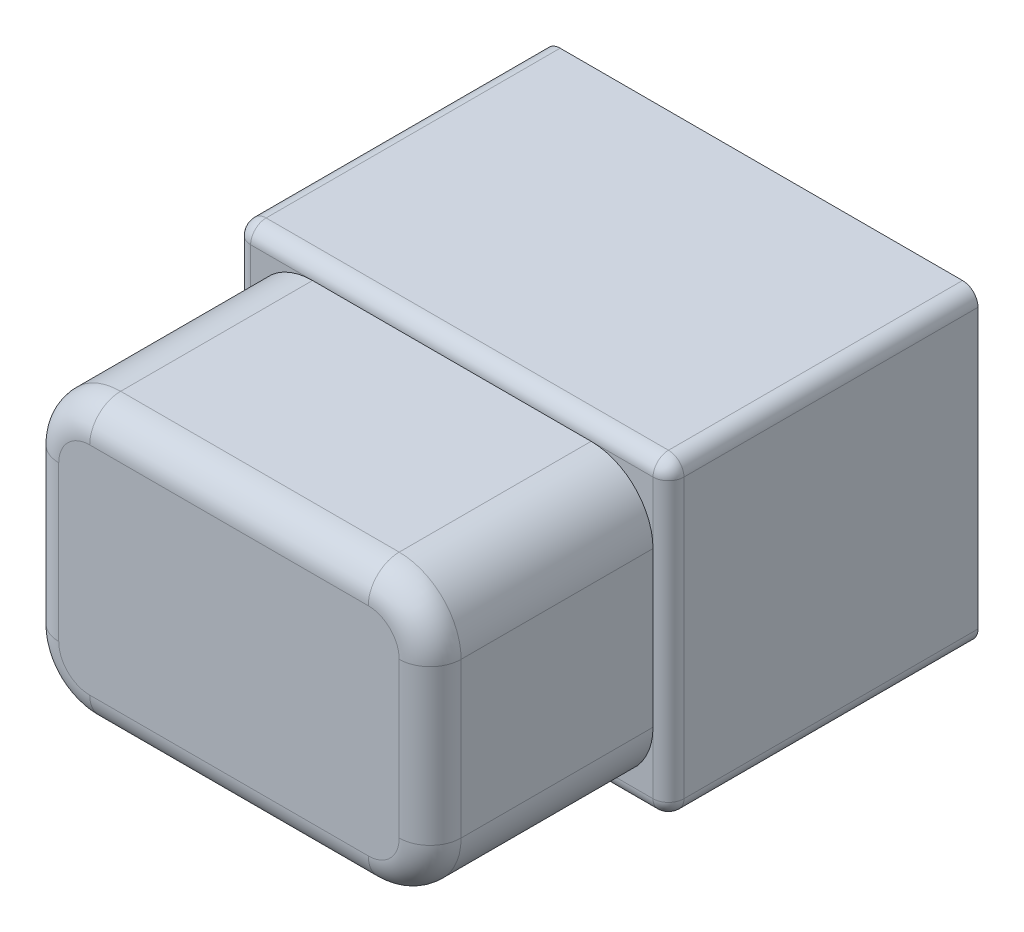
ISO-10303-21;
HEADER;
FILE_DESCRIPTION(('STEP AP214'),'2;1');
FILE_NAME('part.step','',(''),(''),'','','');
FILE_SCHEMA(('AUTOMOTIVE_DESIGN { 1 0 10303 214 1 1 1 1 }'));
ENDSEC;
DATA;
#1=APPLICATION_CONTEXT('core data for automotive mechanical design processes');
#2=APPLICATION_PROTOCOL_DEFINITION('international standard','automotive_design',2000,#1);
#3=PRODUCT_CONTEXT('',#1,'mechanical');
#4=PRODUCT('Part','Part','',(#3));
#5=PRODUCT_RELATED_PRODUCT_CATEGORY('part','',(#4));
#6=PRODUCT_DEFINITION_FORMATION('','',#4);
#7=PRODUCT_DEFINITION_CONTEXT('part definition',#1,'design');
#8=PRODUCT_DEFINITION('design','',#6,#7);
#9=PRODUCT_DEFINITION_SHAPE('','',#8);
#10=(LENGTH_UNIT() NAMED_UNIT(*) SI_UNIT(.MILLI.,.METRE.));
#11=(NAMED_UNIT(*) PLANE_ANGLE_UNIT() SI_UNIT($,.RADIAN.));
#12=(NAMED_UNIT(*) SI_UNIT($,.STERADIAN.) SOLID_ANGLE_UNIT());
#13=UNCERTAINTY_MEASURE_WITH_UNIT(LENGTH_MEASURE(1.E-05),#10,'distance_accuracy_value','');
#14=(GEOMETRIC_REPRESENTATION_CONTEXT(3) GLOBAL_UNCERTAINTY_ASSIGNED_CONTEXT((#13)) GLOBAL_UNIT_ASSIGNED_CONTEXT((#10,
#11,#12)) REPRESENTATION_CONTEXT('',''));
#15=CARTESIAN_POINT('',(0.,0.,0.));
#16=DIRECTION('',(0.,0.,1.));
#17=DIRECTION('',(1.,0.,0.));
#18=AXIS2_PLACEMENT_3D('',#15,#16,#17);
#19=CARTESIAN_POINT('',(0.,0.,50.));
#20=DIRECTION('',(0.,0.,1.));
#21=DIRECTION('',(1.,0.,0.));
#22=AXIS2_PLACEMENT_3D('',#19,#20,#21);
#23=PLANE('',#22);
#24=DIRECTION('',(-1.,0.,0.));
#25=VECTOR('',#24,1.);
#26=CARTESIAN_POINT('',(0.,-76.,50.));
#27=LINE('',#26,#25);
#28=CARTESIAN_POINT('',(327.5,-76.,50.));
#29=VERTEX_POINT('',#28);
#30=CARTESIAN_POINT('',(262.5,-76.,50.));
#31=VERTEX_POINT('',#30);
#32=EDGE_CURVE('E139',#29,#31,#27,.T.);
#33=ORIENTED_EDGE('',*,*,#32,.T.);
#34=DIRECTION('',(0.,-1.,0.));
#35=VECTOR('',#34,1.);
#36=CARTESIAN_POINT('',(262.5,0.,50.));
#37=LINE('',#36,#35);
#38=CARTESIAN_POINT('',(262.5,-121.,50.));
#39=VERTEX_POINT('',#38);
#40=EDGE_CURVE('E195',#31,#39,#37,.T.);
#41=ORIENTED_EDGE('',*,*,#40,.T.);
#42=DIRECTION('',(-1.,0.,0.));
#43=VECTOR('',#42,1.);
#44=CARTESIAN_POINT('',(330.,-121.,50.));
#45=LINE('',#44,#43);
#46=CARTESIAN_POINT('',(327.5,-121.,50.));
#47=VERTEX_POINT('',#46);
#48=EDGE_CURVE('E161',#39,#47,#45,.F.);
#49=ORIENTED_EDGE('',*,*,#48,.T.);
#50=DIRECTION('',(0.,1.,0.));
#51=VECTOR('',#50,1.);
#52=CARTESIAN_POINT('',(327.5,0.,50.));
#53=LINE('',#52,#51);
#54=EDGE_CURVE('E192',#47,#29,#53,.T.);
#55=ORIENTED_EDGE('',*,*,#54,.T.);
#56=EDGE_LOOP('',(#33,#41,#49,#55));
#57=FACE_BOUND('',#56,.T.);
#58=ADVANCED_FACE('F50',(#57),#23,.T.);
#59=CARTESIAN_POINT('',(260.,-73.5,0.));
#60=DIRECTION('',(-1.,0.,0.));
#61=DIRECTION('',(0.,0.,1.));
#62=AXIS2_PLACEMENT_3D('',#59,#60,#61);
#63=PLANE('',#62);
#64=DIRECTION('',(0.,-1.,0.));
#65=VECTOR('',#64,1.);
#66=CARTESIAN_POINT('',(260.,-73.5,47.5));
#67=LINE('',#66,#65);
#68=CARTESIAN_POINT('',(260.,-121.,47.5));
#69=VERTEX_POINT('',#68);
#70=CARTESIAN_POINT('',(260.,-76.,47.5));
#71=VERTEX_POINT('',#70);
#72=EDGE_CURVE('E202',#69,#71,#67,.F.);
#73=ORIENTED_EDGE('',*,*,#72,.T.);
#74=DIRECTION('',(0.,0.,1.));
#75=VECTOR('',#74,1.);
#76=CARTESIAN_POINT('',(260.,-76.,0.));
#77=LINE('',#76,#75);
#78=CARTESIAN_POINT('',(260.,-76.,0.));
#79=VERTEX_POINT('',#78);
#80=EDGE_CURVE('E198',#71,#79,#77,.F.);
#81=ORIENTED_EDGE('',*,*,#80,.T.);
#82=DIRECTION('',(0.,-1.,0.));
#83=VECTOR('',#82,1.);
#84=CARTESIAN_POINT('',(260.,-73.5,0.));
#85=LINE('',#84,#83);
#86=CARTESIAN_POINT('',(260.,-121.,0.));
#87=VERTEX_POINT('',#86);
#88=EDGE_CURVE('E222',#79,#87,#85,.T.);
#89=ORIENTED_EDGE('',*,*,#88,.T.);
#90=DIRECTION('',(0.,0.,-1.));
#91=VECTOR('',#90,1.);
#92=CARTESIAN_POINT('',(260.,-121.,50.));
#93=LINE('',#92,#91);
#94=EDGE_CURVE('E200',#87,#69,#93,.F.);
#95=ORIENTED_EDGE('',*,*,#94,.T.);
#96=EDGE_LOOP('',(#73,#81,#89,#95));
#97=FACE_BOUND('',#96,.T.);
#98=ADVANCED_FACE('F245',(#97),#63,.T.);
#99=CARTESIAN_POINT('',(330.,-73.5,0.));
#100=DIRECTION('',(0.,1.,0.));
#101=DIRECTION('',(0.,0.,1.));
#102=AXIS2_PLACEMENT_3D('',#99,#100,#101);
#103=PLANE('',#102);
#104=DIRECTION('',(-1.,0.,0.));
#105=VECTOR('',#104,1.);
#106=CARTESIAN_POINT('',(330.,-73.5,47.5));
#107=LINE('',#106,#105);
#108=CARTESIAN_POINT('',(262.5,-73.5,47.5));
#109=VERTEX_POINT('',#108);
#110=CARTESIAN_POINT('',(327.5,-73.5,47.5));
#111=VERTEX_POINT('',#110);
#112=EDGE_CURVE('E214',#109,#111,#107,.F.);
#113=ORIENTED_EDGE('',*,*,#112,.T.);
#114=DIRECTION('',(0.,0.,1.));
#115=VECTOR('',#114,1.);
#116=CARTESIAN_POINT('',(327.5,-73.5,0.));
#117=LINE('',#116,#115);
#118=CARTESIAN_POINT('',(327.5,-73.5,0.));
#119=VERTEX_POINT('',#118);
#120=EDGE_CURVE('E210',#111,#119,#117,.F.);
#121=ORIENTED_EDGE('',*,*,#120,.T.);
#122=DIRECTION('',(-1.,0.,0.));
#123=VECTOR('',#122,1.);
#124=CARTESIAN_POINT('',(330.,-73.5,0.));
#125=LINE('',#124,#123);
#126=CARTESIAN_POINT('',(262.5,-73.5,0.));
#127=VERTEX_POINT('',#126);
#128=EDGE_CURVE('E225',#119,#127,#125,.T.);
#129=ORIENTED_EDGE('',*,*,#128,.T.);
#130=DIRECTION('',(0.,0.,1.));
#131=VECTOR('',#130,1.);
#132=CARTESIAN_POINT('',(262.5,-73.5,0.));
#133=LINE('',#132,#131);
#134=EDGE_CURVE('E212',#127,#109,#133,.T.);
#135=ORIENTED_EDGE('',*,*,#134,.T.);
#136=EDGE_LOOP('',(#113,#121,#129,#135));
#137=FACE_BOUND('',#136,.T.);
#138=ADVANCED_FACE('F255',(#137),#103,.T.);
#139=CARTESIAN_POINT('',(330.,-91.,0.));
#140=DIRECTION('',(1.,0.,0.));
#141=DIRECTION('',(0.,0.,-1.));
#142=AXIS2_PLACEMENT_3D('',#139,#140,#141);
#143=PLANE('',#142);
#144=DIRECTION('',(0.,1.,0.));
#145=VECTOR('',#144,1.);
#146=CARTESIAN_POINT('',(330.,-91.,0.));
#147=LINE('',#146,#145);
#148=CARTESIAN_POINT('',(330.,-121.,0.));
#149=VERTEX_POINT('',#148);
#150=CARTESIAN_POINT('',(330.,-76.,0.));
#151=VERTEX_POINT('',#150);
#152=EDGE_CURVE('E227',#149,#151,#147,.T.);
#153=ORIENTED_EDGE('',*,*,#152,.T.);
#154=DIRECTION('',(0.,0.,1.));
#155=VECTOR('',#154,1.);
#156=CARTESIAN_POINT('',(330.,-76.,0.));
#157=LINE('',#156,#155);
#158=CARTESIAN_POINT('',(330.,-76.,47.5));
#159=VERTEX_POINT('',#158);
#160=EDGE_CURVE('E216',#151,#159,#157,.T.);
#161=ORIENTED_EDGE('',*,*,#160,.T.);
#162=DIRECTION('',(0.,1.,0.));
#163=VECTOR('',#162,1.);
#164=CARTESIAN_POINT('',(330.,-91.,47.5));
#165=LINE('',#164,#163);
#166=CARTESIAN_POINT('',(330.,-121.,47.5));
#167=VERTEX_POINT('',#166);
#168=EDGE_CURVE('E219',#159,#167,#165,.F.);
#169=ORIENTED_EDGE('',*,*,#168,.T.);
#170=DIRECTION('',(0.,0.,1.));
#171=VECTOR('',#170,1.);
#172=CARTESIAN_POINT('',(330.,-121.,0.));
#173=LINE('',#172,#171);
#174=EDGE_CURVE('E66',#167,#149,#173,.F.);
#175=ORIENTED_EDGE('',*,*,#174,.T.);
#176=EDGE_LOOP('',(#153,#161,#169,#175));
#177=FACE_BOUND('',#176,.T.);
#178=ADVANCED_FACE('F282',(#177),#143,.T.);
#179=CARTESIAN_POINT('',(0.,0.,0.));
#180=DIRECTION('',(0.,0.,1.));
#181=DIRECTION('',(1.,0.,0.));
#182=AXIS2_PLACEMENT_3D('',#179,#180,#181);
#183=PLANE('',#182);
#184=ORIENTED_EDGE('',*,*,#128,.F.);
#185=CARTESIAN_POINT('',(327.5,-76.,0.));
#186=DIRECTION('',(0.,0.,1.));
#187=DIRECTION('',(1.,0.,0.));
#188=AXIS2_PLACEMENT_3D('',#185,#186,#187);
#189=CIRCLE('',#188,2.5);
#190=EDGE_CURVE('E73',#119,#151,#189,.F.);
#191=ORIENTED_EDGE('',*,*,#190,.T.);
#192=ORIENTED_EDGE('',*,*,#152,.F.);
#193=CARTESIAN_POINT('',(327.5,-121.,0.));
#194=DIRECTION('',(0.,0.,1.));
#195=DIRECTION('',(1.,0.,0.));
#196=AXIS2_PLACEMENT_3D('',#193,#194,#195);
#197=CIRCLE('',#196,2.5);
#198=CARTESIAN_POINT('',(327.5,-123.5,0.));
#199=VERTEX_POINT('',#198);
#200=EDGE_CURVE('E208',#149,#199,#197,.F.);
#201=ORIENTED_EDGE('',*,*,#200,.T.);
#202=DIRECTION('',(1.,0.,0.));
#203=VECTOR('',#202,1.);
#204=CARTESIAN_POINT('',(330.,-123.5,0.));
#205=LINE('',#204,#203);
#206=CARTESIAN_POINT('',(262.5,-123.5,0.));
#207=VERTEX_POINT('',#206);
#208=EDGE_CURVE('E53',#207,#199,#205,.T.);
#209=ORIENTED_EDGE('',*,*,#208,.F.);
#210=CARTESIAN_POINT('',(262.5,-121.,0.));
#211=DIRECTION('',(0.,0.,1.));
#212=DIRECTION('',(1.,0.,0.));
#213=AXIS2_PLACEMENT_3D('',#210,#211,#212);
#214=CIRCLE('',#213,2.5);
#215=EDGE_CURVE('E149',#207,#87,#214,.F.);
#216=ORIENTED_EDGE('',*,*,#215,.T.);
#217=ORIENTED_EDGE('',*,*,#88,.F.);
#218=CARTESIAN_POINT('',(262.5,-76.,0.));
#219=DIRECTION('',(0.,0.,1.));
#220=DIRECTION('',(1.,0.,0.));
#221=AXIS2_PLACEMENT_3D('',#218,#219,#220);
#222=CIRCLE('',#221,2.5);
#223=EDGE_CURVE('E205',#79,#127,#222,.F.);
#224=ORIENTED_EDGE('',*,*,#223,.T.);
#225=EDGE_LOOP('',(#184,#191,#192,#201,#209,#216,#217,#224));
#226=FACE_BOUND('',#225,.T.);
#227=ADVANCED_FACE('F253',(#226),#183,.F.);
#228=CARTESIAN_POINT('',(0.,-123.5,0.));
#229=DIRECTION('',(0.,1.,0.));
#230=DIRECTION('',(-1.,0.,0.));
#231=AXIS2_PLACEMENT_3D('',#228,#229,#230);
#232=PLANE('',#231);
#233=DIRECTION('',(-1.,0.,0.));
#234=VECTOR('',#233,1.);
#235=CARTESIAN_POINT('',(260.,-123.5,47.5));
#236=LINE('',#235,#234);
#237=CARTESIAN_POINT('',(327.5,-123.5,47.5));
#238=VERTEX_POINT('',#237);
#239=CARTESIAN_POINT('',(262.5,-123.5,47.5));
#240=VERTEX_POINT('',#239);
#241=EDGE_CURVE('E127',#238,#240,#236,.T.);
#242=ORIENTED_EDGE('',*,*,#241,.T.);
#243=DIRECTION('',(0.,0.,-1.));
#244=VECTOR('',#243,1.);
#245=CARTESIAN_POINT('',(262.5,-123.5,0.));
#246=LINE('',#245,#244);
#247=EDGE_CURVE('E131',#240,#207,#246,.T.);
#248=ORIENTED_EDGE('',*,*,#247,.T.);
#249=ORIENTED_EDGE('',*,*,#208,.T.);
#250=DIRECTION('',(0.,0.,1.));
#251=VECTOR('',#250,1.);
#252=CARTESIAN_POINT('',(327.5,-123.5,50.));
#253=LINE('',#252,#251);
#254=EDGE_CURVE('E134',#199,#238,#253,.T.);
#255=ORIENTED_EDGE('',*,*,#254,.T.);
#256=EDGE_LOOP('',(#242,#248,#249,#255));
#257=FACE_BOUND('',#256,.T.);
#258=ADVANCED_FACE('F129',(#257),#232,.F.);
#259=CARTESIAN_POINT('',(262.5,-121.,0.));
#260=DIRECTION('',(0.,0.,1.));
#261=DIRECTION('',(1.,0.,0.));
#262=AXIS2_PLACEMENT_3D('',#259,#260,#261);
#263=CYLINDRICAL_SURFACE('',#262,2.5);
#264=CARTESIAN_POINT('',(262.5,-121.,47.5));
#265=DIRECTION('',(0.,0.,1.));
#266=DIRECTION('',(1.,0.,0.));
#267=AXIS2_PLACEMENT_3D('',#264,#265,#266);
#268=CIRCLE('',#267,2.5);
#269=EDGE_CURVE('E147',#69,#240,#268,.T.);
#270=ORIENTED_EDGE('',*,*,#269,.F.);
#271=ORIENTED_EDGE('',*,*,#94,.F.);
#272=ORIENTED_EDGE('',*,*,#215,.F.);
#273=ORIENTED_EDGE('',*,*,#247,.F.);
#274=EDGE_LOOP('',(#270,#271,#272,#273));
#275=FACE_BOUND('',#274,.T.);
#276=ADVANCED_FACE('F145',(#275),#263,.T.);
#277=CARTESIAN_POINT('',(262.5,-121.,47.5));
#278=DIRECTION('',(0.,0.,1.));
#279=DIRECTION('',(1.,0.,0.));
#280=AXIS2_PLACEMENT_3D('',#277,#278,#279);
#281=SPHERICAL_SURFACE('',#280,2.5);
#282=CARTESIAN_POINT('',(262.5,-121.,47.5));
#283=DIRECTION('',(0.,-1.,0.));
#284=DIRECTION('',(0.,0.,-1.));
#285=AXIS2_PLACEMENT_3D('',#282,#283,#284);
#286=CIRCLE('',#285,2.5);
#287=EDGE_CURVE('E156',#69,#39,#286,.F.);
#288=ORIENTED_EDGE('',*,*,#287,.F.);
#289=ORIENTED_EDGE('',*,*,#269,.T.);
#290=CARTESIAN_POINT('',(262.5,-121.,47.5));
#291=DIRECTION('',(-1.,0.,0.));
#292=DIRECTION('',(0.,0.,1.));
#293=AXIS2_PLACEMENT_3D('',#290,#291,#292);
#294=CIRCLE('',#293,2.5);
#295=EDGE_CURVE('E154',#39,#240,#294,.F.);
#296=ORIENTED_EDGE('',*,*,#295,.F.);
#297=EDGE_LOOP('',(#288,#289,#296));
#298=FACE_BOUND('',#297,.T.);
#299=ADVANCED_FACE('F153',(#298),#281,.T.);
#300=CARTESIAN_POINT('',(327.5,-121.,0.));
#301=DIRECTION('',(0.,0.,-1.));
#302=DIRECTION('',(-1.,0.,0.));
#303=AXIS2_PLACEMENT_3D('',#300,#301,#302);
#304=CYLINDRICAL_SURFACE('',#303,2.5);
#305=ORIENTED_EDGE('',*,*,#200,.F.);
#306=ORIENTED_EDGE('',*,*,#174,.F.);
#307=CARTESIAN_POINT('',(327.5,-121.,47.5));
#308=DIRECTION('',(0.,0.,1.));
#309=DIRECTION('',(1.,0.,0.));
#310=AXIS2_PLACEMENT_3D('',#307,#308,#309);
#311=CIRCLE('',#310,2.5);
#312=EDGE_CURVE('E164',#238,#167,#311,.T.);
#313=ORIENTED_EDGE('',*,*,#312,.F.);
#314=ORIENTED_EDGE('',*,*,#254,.F.);
#315=EDGE_LOOP('',(#305,#306,#313,#314));
#316=FACE_BOUND('',#315,.T.);
#317=ADVANCED_FACE('F231',(#316),#304,.T.);
#318=CARTESIAN_POINT('',(0.,-121.,47.5));
#319=DIRECTION('',(1.,0.,0.));
#320=DIRECTION('',(0.,1.,0.));
#321=AXIS2_PLACEMENT_3D('',#318,#319,#320);
#322=CYLINDRICAL_SURFACE('',#321,2.5);
#323=ORIENTED_EDGE('',*,*,#295,.T.);
#324=ORIENTED_EDGE('',*,*,#241,.F.);
#325=CARTESIAN_POINT('',(327.5,-121.,47.5));
#326=DIRECTION('',(1.,0.,0.));
#327=DIRECTION('',(0.,0.,-1.));
#328=AXIS2_PLACEMENT_3D('',#325,#326,#327);
#329=CIRCLE('',#328,2.5);
#330=EDGE_CURVE('E169',#47,#238,#329,.T.);
#331=ORIENTED_EDGE('',*,*,#330,.F.);
#332=ORIENTED_EDGE('',*,*,#48,.F.);
#333=EDGE_LOOP('',(#323,#324,#331,#332));
#334=FACE_BOUND('',#333,.T.);
#335=ADVANCED_FACE('F159',(#334),#322,.T.);
#336=CARTESIAN_POINT('',(262.5,0.,47.5));
#337=DIRECTION('',(0.,-1.,0.));
#338=DIRECTION('',(0.,0.,-1.));
#339=AXIS2_PLACEMENT_3D('',#336,#337,#338);
#340=CYLINDRICAL_SURFACE('',#339,2.5);
#341=ORIENTED_EDGE('',*,*,#287,.T.);
#342=ORIENTED_EDGE('',*,*,#40,.F.);
#343=CARTESIAN_POINT('',(262.5,-76.,47.5));
#344=DIRECTION('',(0.,1.,0.));
#345=DIRECTION('',(0.,0.,1.));
#346=AXIS2_PLACEMENT_3D('',#343,#344,#345);
#347=CIRCLE('',#346,2.5);
#348=EDGE_CURVE('E172',#71,#31,#347,.T.);
#349=ORIENTED_EDGE('',*,*,#348,.F.);
#350=ORIENTED_EDGE('',*,*,#72,.F.);
#351=EDGE_LOOP('',(#341,#342,#349,#350));
#352=FACE_BOUND('',#351,.T.);
#353=ADVANCED_FACE('F242',(#352),#340,.T.);
#354=CARTESIAN_POINT('',(262.5,-76.,0.));
#355=DIRECTION('',(0.,0.,1.));
#356=DIRECTION('',(1.,0.,0.));
#357=AXIS2_PLACEMENT_3D('',#354,#355,#356);
#358=CYLINDRICAL_SURFACE('',#357,2.5);
#359=ORIENTED_EDGE('',*,*,#223,.F.);
#360=ORIENTED_EDGE('',*,*,#80,.F.);
#361=CARTESIAN_POINT('',(262.5,-76.,47.5));
#362=DIRECTION('',(0.,0.,1.));
#363=DIRECTION('',(1.,0.,0.));
#364=AXIS2_PLACEMENT_3D('',#361,#362,#363);
#365=CIRCLE('',#364,2.5);
#366=EDGE_CURVE('E175',#109,#71,#365,.T.);
#367=ORIENTED_EDGE('',*,*,#366,.F.);
#368=ORIENTED_EDGE('',*,*,#134,.F.);
#369=EDGE_LOOP('',(#359,#360,#367,#368));
#370=FACE_BOUND('',#369,.T.);
#371=ADVANCED_FACE('F250',(#370),#358,.T.);
#372=CARTESIAN_POINT('',(327.5,-121.,47.5));
#373=DIRECTION('',(0.,0.,1.));
#374=DIRECTION('',(1.,0.,0.));
#375=AXIS2_PLACEMENT_3D('',#372,#373,#374);
#376=SPHERICAL_SURFACE('',#375,2.5);
#377=ORIENTED_EDGE('',*,*,#330,.T.);
#378=ORIENTED_EDGE('',*,*,#312,.T.);
#379=CARTESIAN_POINT('',(327.5,-121.,47.5));
#380=DIRECTION('',(0.,-1.,0.));
#381=DIRECTION('',(0.,0.,-1.));
#382=AXIS2_PLACEMENT_3D('',#379,#380,#381);
#383=CIRCLE('',#382,2.5);
#384=EDGE_CURVE('E178',#47,#167,#383,.F.);
#385=ORIENTED_EDGE('',*,*,#384,.F.);
#386=EDGE_LOOP('',(#377,#378,#385));
#387=FACE_BOUND('',#386,.T.);
#388=ADVANCED_FACE('F234',(#387),#376,.T.);
#389=CARTESIAN_POINT('',(262.5,-76.,47.5));
#390=DIRECTION('',(0.,0.,1.));
#391=DIRECTION('',(1.,0.,0.));
#392=AXIS2_PLACEMENT_3D('',#389,#390,#391);
#393=SPHERICAL_SURFACE('',#392,2.5);
#394=ORIENTED_EDGE('',*,*,#366,.T.);
#395=ORIENTED_EDGE('',*,*,#348,.T.);
#396=CARTESIAN_POINT('',(262.5,-76.,47.5));
#397=DIRECTION('',(-1.,0.,0.));
#398=DIRECTION('',(0.,0.,1.));
#399=AXIS2_PLACEMENT_3D('',#396,#397,#398);
#400=CIRCLE('',#399,2.5);
#401=EDGE_CURVE('E181',#109,#31,#400,.F.);
#402=ORIENTED_EDGE('',*,*,#401,.F.);
#403=EDGE_LOOP('',(#394,#395,#402));
#404=FACE_BOUND('',#403,.T.);
#405=ADVANCED_FACE('F267',(#404),#393,.T.);
#406=CARTESIAN_POINT('',(327.5,0.,47.5));
#407=DIRECTION('',(0.,1.,0.));
#408=DIRECTION('',(0.,0.,1.));
#409=AXIS2_PLACEMENT_3D('',#406,#407,#408);
#410=CYLINDRICAL_SURFACE('',#409,2.5);
#411=ORIENTED_EDGE('',*,*,#384,.T.);
#412=ORIENTED_EDGE('',*,*,#168,.F.);
#413=CARTESIAN_POINT('',(327.5,-76.,47.5));
#414=DIRECTION('',(0.,1.,0.));
#415=DIRECTION('',(0.,0.,1.));
#416=AXIS2_PLACEMENT_3D('',#413,#414,#415);
#417=CIRCLE('',#416,2.5);
#418=EDGE_CURVE('E184',#29,#159,#417,.T.);
#419=ORIENTED_EDGE('',*,*,#418,.F.);
#420=ORIENTED_EDGE('',*,*,#54,.F.);
#421=EDGE_LOOP('',(#411,#412,#419,#420));
#422=FACE_BOUND('',#421,.T.);
#423=ADVANCED_FACE('F237',(#422),#410,.T.);
#424=CARTESIAN_POINT('',(0.,-76.,47.5));
#425=DIRECTION('',(-1.,0.,0.));
#426=DIRECTION('',(0.,0.,1.));
#427=AXIS2_PLACEMENT_3D('',#424,#425,#426);
#428=CYLINDRICAL_SURFACE('',#427,2.5);
#429=ORIENTED_EDGE('',*,*,#401,.T.);
#430=ORIENTED_EDGE('',*,*,#32,.F.);
#431=CARTESIAN_POINT('',(327.5,-76.,47.5));
#432=DIRECTION('',(1.,0.,0.));
#433=DIRECTION('',(0.,0.,-1.));
#434=AXIS2_PLACEMENT_3D('',#431,#432,#433);
#435=CIRCLE('',#434,2.5);
#436=EDGE_CURVE('E58',#111,#29,#435,.T.);
#437=ORIENTED_EDGE('',*,*,#436,.F.);
#438=ORIENTED_EDGE('',*,*,#112,.F.);
#439=EDGE_LOOP('',(#429,#430,#437,#438));
#440=FACE_BOUND('',#439,.T.);
#441=ADVANCED_FACE('F265',(#440),#428,.T.);
#442=CARTESIAN_POINT('',(327.5,-76.,47.5));
#443=DIRECTION('',(0.,0.,1.));
#444=DIRECTION('',(1.,0.,0.));
#445=AXIS2_PLACEMENT_3D('',#442,#443,#444);
#446=SPHERICAL_SURFACE('',#445,2.5);
#447=ORIENTED_EDGE('',*,*,#436,.T.);
#448=ORIENTED_EDGE('',*,*,#418,.T.);
#449=CARTESIAN_POINT('',(327.5,-76.,47.5));
#450=DIRECTION('',(0.,0.,1.));
#451=DIRECTION('',(1.,0.,0.));
#452=AXIS2_PLACEMENT_3D('',#449,#450,#451);
#453=CIRCLE('',#452,2.5);
#454=EDGE_CURVE('E12',#111,#159,#453,.F.);
#455=ORIENTED_EDGE('',*,*,#454,.F.);
#456=EDGE_LOOP('',(#447,#448,#455));
#457=FACE_BOUND('',#456,.T.);
#458=ADVANCED_FACE('F263',(#457),#446,.T.);
#459=CARTESIAN_POINT('',(327.5,-76.,0.));
#460=DIRECTION('',(0.,0.,1.));
#461=DIRECTION('',(1.,0.,0.));
#462=AXIS2_PLACEMENT_3D('',#459,#460,#461);
#463=CYLINDRICAL_SURFACE('',#462,2.5);
#464=ORIENTED_EDGE('',*,*,#190,.F.);
#465=ORIENTED_EDGE('',*,*,#120,.F.);
#466=ORIENTED_EDGE('',*,*,#454,.T.);
#467=ORIENTED_EDGE('',*,*,#160,.F.);
#468=EDGE_LOOP('',(#464,#465,#466,#467));
#469=FACE_BOUND('',#468,.T.);
#470=ADVANCED_FACE('F261',(#469),#463,.T.);
#471=CLOSED_SHELL('',(#58,#98,#138,#178,#227,#258,#276,#299,#317,#335,#353,#371,#388,#405,#423,
#441,#458,#470));
#472=MANIFOLD_SOLID_BREP('B2',#471);
#473=CARTESIAN_POINT('',(0.,0.,50.));
#474=DIRECTION('',(0.,0.,1.));
#475=DIRECTION('',(1.,0.,0.));
#476=AXIS2_PLACEMENT_3D('',#473,#474,#475);
#477=PLANE('',#476);
#478=CARTESIAN_POINT('',(317.5,-111.,50.));
#479=DIRECTION('',(0.,0.,1.));
#480=DIRECTION('',(1.,0.,0.));
#481=AXIS2_PLACEMENT_3D('',#478,#479,#480);
#482=CIRCLE('',#481,10.);
#483=CARTESIAN_POINT('',(327.5,-111.,50.));
#484=VERTEX_POINT('',#483);
#485=CARTESIAN_POINT('',(317.5,-121.,50.));
#486=VERTEX_POINT('',#485);
#487=EDGE_CURVE('E587',#484,#486,#482,.F.);
#488=ORIENTED_EDGE('',*,*,#487,.T.);
#489=DIRECTION('',(1.,0.,0.));
#490=VECTOR('',#489,1.);
#491=CARTESIAN_POINT('',(262.5,-121.,50.));
#492=LINE('',#491,#490);
#493=CARTESIAN_POINT('',(272.5,-121.,50.));
#494=VERTEX_POINT('',#493);
#495=EDGE_CURVE('E444',#494,#486,#492,.T.);
#496=ORIENTED_EDGE('',*,*,#495,.F.);
#497=CARTESIAN_POINT('',(272.5,-111.,50.));
#498=DIRECTION('',(0.,0.,1.));
#499=DIRECTION('',(1.,0.,0.));
#500=AXIS2_PLACEMENT_3D('',#497,#498,#499);
#501=CIRCLE('',#500,10.);
#502=CARTESIAN_POINT('',(262.5,-111.,50.));
#503=VERTEX_POINT('',#502);
#504=EDGE_CURVE('E48',#494,#503,#501,.F.);
#505=ORIENTED_EDGE('',*,*,#504,.T.);
#506=DIRECTION('',(0.,-1.,0.));
#507=VECTOR('',#506,1.);
#508=CARTESIAN_POINT('',(262.5,-76.,50.));
#509=LINE('',#508,#507);
#510=CARTESIAN_POINT('',(262.5,-86.,50.));
#511=VERTEX_POINT('',#510);
#512=EDGE_CURVE('E530',#511,#503,#509,.T.);
#513=ORIENTED_EDGE('',*,*,#512,.F.);
#514=CARTESIAN_POINT('',(272.5,-86.,50.));
#515=DIRECTION('',(0.,0.,1.));
#516=DIRECTION('',(1.,0.,0.));
#517=AXIS2_PLACEMENT_3D('',#514,#515,#516);
#518=CIRCLE('',#517,10.);
#519=CARTESIAN_POINT('',(272.5,-76.,50.));
#520=VERTEX_POINT('',#519);
#521=EDGE_CURVE('E436',#511,#520,#518,.F.);
#522=ORIENTED_EDGE('',*,*,#521,.T.);
#523=DIRECTION('',(-1.,0.,0.));
#524=VECTOR('',#523,1.);
#525=CARTESIAN_POINT('',(327.5,-76.,50.));
#526=LINE('',#525,#524);
#527=CARTESIAN_POINT('',(317.5,-76.,50.));
#528=VERTEX_POINT('',#527);
#529=EDGE_CURVE('E520',#528,#520,#526,.T.);
#530=ORIENTED_EDGE('',*,*,#529,.F.);
#531=CARTESIAN_POINT('',(317.5,-86.,50.));
#532=DIRECTION('',(0.,0.,1.));
#533=DIRECTION('',(1.,0.,0.));
#534=AXIS2_PLACEMENT_3D('',#531,#532,#533);
#535=CIRCLE('',#534,10.);
#536=CARTESIAN_POINT('',(327.5,-86.,50.));
#537=VERTEX_POINT('',#536);
#538=EDGE_CURVE('E537',#528,#537,#535,.F.);
#539=ORIENTED_EDGE('',*,*,#538,.T.);
#540=DIRECTION('',(0.,1.,0.));
#541=VECTOR('',#540,1.);
#542=CARTESIAN_POINT('',(327.5,-121.,50.));
#543=LINE('',#542,#541);
#544=EDGE_CURVE('E531',#484,#537,#543,.T.);
#545=ORIENTED_EDGE('',*,*,#544,.F.);
#546=EDGE_LOOP('',(#488,#496,#505,#513,#522,#530,#539,#545));
#547=FACE_BOUND('',#546,.T.);
#548=ADVANCED_FACE('F428',(#547),#477,.F.);
#549=CARTESIAN_POINT('',(0.,0.,86.));
#550=DIRECTION('',(0.,0.,1.));
#551=DIRECTION('',(1.,0.,0.));
#552=AXIS2_PLACEMENT_3D('',#549,#550,#551);
#553=PLANE('',#552);
#554=DIRECTION('',(0.,1.,0.));
#555=VECTOR('',#554,1.);
#556=CARTESIAN_POINT('',(322.5,-86.,86.));
#557=LINE('',#556,#555);
#558=CARTESIAN_POINT('',(322.5,-111.,86.));
#559=VERTEX_POINT('',#558);
#560=CARTESIAN_POINT('',(322.5,-86.,86.));
#561=VERTEX_POINT('',#560);
#562=EDGE_CURVE('E566',#559,#561,#557,.T.);
#563=ORIENTED_EDGE('',*,*,#562,.T.);
#564=CARTESIAN_POINT('',(317.5,-86.,86.));
#565=DIRECTION('',(0.,0.,1.));
#566=DIRECTION('',(1.,0.,0.));
#567=AXIS2_PLACEMENT_3D('',#564,#565,#566);
#568=CIRCLE('',#567,5.);
#569=CARTESIAN_POINT('',(317.5,-81.,86.));
#570=VERTEX_POINT('',#569);
#571=EDGE_CURVE('E568',#561,#570,#568,.T.);
#572=ORIENTED_EDGE('',*,*,#571,.T.);
#573=DIRECTION('',(-1.,0.,0.));
#574=VECTOR('',#573,1.);
#575=CARTESIAN_POINT('',(272.5,-81.,86.));
#576=LINE('',#575,#574);
#577=CARTESIAN_POINT('',(272.5,-81.,86.));
#578=VERTEX_POINT('',#577);
#579=EDGE_CURVE('E554',#570,#578,#576,.T.);
#580=ORIENTED_EDGE('',*,*,#579,.T.);
#581=CARTESIAN_POINT('',(272.5,-86.,86.));
#582=DIRECTION('',(0.,0.,1.));
#583=DIRECTION('',(1.,0.,0.));
#584=AXIS2_PLACEMENT_3D('',#581,#582,#583);
#585=CIRCLE('',#584,5.);
#586=CARTESIAN_POINT('',(267.5,-86.,86.));
#587=VERTEX_POINT('',#586);
#588=EDGE_CURVE('E556',#578,#587,#585,.T.);
#589=ORIENTED_EDGE('',*,*,#588,.T.);
#590=DIRECTION('',(0.,-1.,0.));
#591=VECTOR('',#590,1.);
#592=CARTESIAN_POINT('',(267.5,-111.,86.));
#593=LINE('',#592,#591);
#594=CARTESIAN_POINT('',(267.5,-111.,86.));
#595=VERTEX_POINT('',#594);
#596=EDGE_CURVE('E558',#587,#595,#593,.T.);
#597=ORIENTED_EDGE('',*,*,#596,.T.);
#598=CARTESIAN_POINT('',(272.5,-111.,86.));
#599=DIRECTION('',(0.,0.,1.));
#600=DIRECTION('',(1.,0.,0.));
#601=AXIS2_PLACEMENT_3D('',#598,#599,#600);
#602=CIRCLE('',#601,5.);
#603=CARTESIAN_POINT('',(272.5,-116.,86.));
#604=VERTEX_POINT('',#603);
#605=EDGE_CURVE('E560',#595,#604,#602,.T.);
#606=ORIENTED_EDGE('',*,*,#605,.T.);
#607=DIRECTION('',(1.,0.,0.));
#608=VECTOR('',#607,1.);
#609=CARTESIAN_POINT('',(317.5,-116.,86.));
#610=LINE('',#609,#608);
#611=CARTESIAN_POINT('',(317.5,-116.,86.));
#612=VERTEX_POINT('',#611);
#613=EDGE_CURVE('E562',#604,#612,#610,.T.);
#614=ORIENTED_EDGE('',*,*,#613,.T.);
#615=CARTESIAN_POINT('',(317.5,-111.,86.));
#616=DIRECTION('',(0.,0.,1.));
#617=DIRECTION('',(1.,0.,0.));
#618=AXIS2_PLACEMENT_3D('',#615,#616,#617);
#619=CIRCLE('',#618,5.);
#620=EDGE_CURVE('E564',#612,#559,#619,.T.);
#621=ORIENTED_EDGE('',*,*,#620,.T.);
#622=EDGE_LOOP('',(#563,#572,#580,#589,#597,#606,#614,#621));
#623=FACE_BOUND('',#622,.T.);
#624=ADVANCED_FACE('F649',(#623),#553,.T.);
#625=CARTESIAN_POINT('',(0.,-116.,81.));
#626=DIRECTION('',(-1.,0.,0.));
#627=DIRECTION('',(0.,-1.,0.));
#628=AXIS2_PLACEMENT_3D('',#625,#626,#627);
#629=CYLINDRICAL_SURFACE('',#628,5.);
#630=CARTESIAN_POINT('',(272.5,-116.,81.));
#631=DIRECTION('',(1.,0.,0.));
#632=DIRECTION('',(0.,0.,-1.));
#633=AXIS2_PLACEMENT_3D('',#630,#631,#632);
#634=CIRCLE('',#633,5.);
#635=CARTESIAN_POINT('',(272.5,-121.,81.));
#636=VERTEX_POINT('',#635);
#637=EDGE_CURVE('E431',#604,#636,#634,.T.);
#638=ORIENTED_EDGE('',*,*,#637,.T.);
#639=DIRECTION('',(1.,0.,0.));
#640=VECTOR('',#639,1.);
#641=CARTESIAN_POINT('',(272.5,-121.,81.));
#642=LINE('',#641,#640);
#643=CARTESIAN_POINT('',(317.5,-121.,81.));
#644=VERTEX_POINT('',#643);
#645=EDGE_CURVE('E578',#644,#636,#642,.F.);
#646=ORIENTED_EDGE('',*,*,#645,.F.);
#647=CARTESIAN_POINT('',(317.5,-116.,81.));
#648=DIRECTION('',(1.,0.,0.));
#649=DIRECTION('',(0.,0.,-1.));
#650=AXIS2_PLACEMENT_3D('',#647,#648,#649);
#651=CIRCLE('',#650,5.);
#652=EDGE_CURVE('E601',#612,#644,#651,.T.);
#653=ORIENTED_EDGE('',*,*,#652,.F.);
#654=ORIENTED_EDGE('',*,*,#613,.F.);
#655=EDGE_LOOP('',(#638,#646,#653,#654));
#656=FACE_BOUND('',#655,.T.);
#657=ADVANCED_FACE('F642',(#656),#629,.T.);
#658=CARTESIAN_POINT('',(322.5,0.,81.));
#659=DIRECTION('',(0.,-1.,0.));
#660=DIRECTION('',(0.,0.,-1.));
#661=AXIS2_PLACEMENT_3D('',#658,#659,#660);
#662=CYLINDRICAL_SURFACE('',#661,5.);
#663=CARTESIAN_POINT('',(322.5,-111.,81.));
#664=DIRECTION('',(0.,1.,0.));
#665=DIRECTION('',(0.,0.,1.));
#666=AXIS2_PLACEMENT_3D('',#663,#664,#665);
#667=CIRCLE('',#666,5.);
#668=CARTESIAN_POINT('',(327.5,-111.,81.));
#669=VERTEX_POINT('',#668);
#670=EDGE_CURVE('E595',#559,#669,#667,.T.);
#671=ORIENTED_EDGE('',*,*,#670,.T.);
#672=DIRECTION('',(0.,1.,0.));
#673=VECTOR('',#672,1.);
#674=CARTESIAN_POINT('',(327.5,-111.,81.));
#675=LINE('',#674,#673);
#676=CARTESIAN_POINT('',(327.5,-86.,81.));
#677=VERTEX_POINT('',#676);
#678=EDGE_CURVE('E574',#677,#669,#675,.F.);
#679=ORIENTED_EDGE('',*,*,#678,.F.);
#680=CARTESIAN_POINT('',(322.5,-86.,81.));
#681=DIRECTION('',(0.,1.,0.));
#682=DIRECTION('',(0.,0.,1.));
#683=AXIS2_PLACEMENT_3D('',#680,#681,#682);
#684=CIRCLE('',#683,5.);
#685=EDGE_CURVE('E590',#561,#677,#684,.T.);
#686=ORIENTED_EDGE('',*,*,#685,.F.);
#687=ORIENTED_EDGE('',*,*,#562,.F.);
#688=EDGE_LOOP('',(#671,#679,#686,#687));
#689=FACE_BOUND('',#688,.T.);
#690=ADVANCED_FACE('F668',(#689),#662,.T.);
#691=CARTESIAN_POINT('',(0.,-81.,81.));
#692=DIRECTION('',(1.,0.,0.));
#693=DIRECTION('',(0.,0.,-1.));
#694=AXIS2_PLACEMENT_3D('',#691,#692,#693);
#695=CYLINDRICAL_SURFACE('',#694,5.);
#696=CARTESIAN_POINT('',(272.5,-81.,81.));
#697=DIRECTION('',(1.,0.,0.));
#698=DIRECTION('',(0.,0.,-1.));
#699=AXIS2_PLACEMENT_3D('',#696,#697,#698);
#700=CIRCLE('',#699,5.);
#701=CARTESIAN_POINT('',(272.5,-76.,81.));
#702=VERTEX_POINT('',#701);
#703=EDGE_CURVE('E592',#702,#578,#700,.T.);
#704=ORIENTED_EDGE('',*,*,#703,.T.);
#705=ORIENTED_EDGE('',*,*,#579,.F.);
#706=CARTESIAN_POINT('',(317.5,-81.,81.));
#707=DIRECTION('',(1.,0.,0.));
#708=DIRECTION('',(0.,0.,-1.));
#709=AXIS2_PLACEMENT_3D('',#706,#707,#708);
#710=CIRCLE('',#709,5.);
#711=CARTESIAN_POINT('',(317.5,-76.,81.));
#712=VERTEX_POINT('',#711);
#713=EDGE_CURVE('E588',#712,#570,#710,.T.);
#714=ORIENTED_EDGE('',*,*,#713,.F.);
#715=DIRECTION('',(-1.,0.,0.));
#716=VECTOR('',#715,1.);
#717=CARTESIAN_POINT('',(317.5,-76.,81.));
#718=LINE('',#717,#716);
#719=EDGE_CURVE('E585',#702,#712,#718,.F.);
#720=ORIENTED_EDGE('',*,*,#719,.F.);
#721=EDGE_LOOP('',(#704,#705,#714,#720));
#722=FACE_BOUND('',#721,.T.);
#723=ADVANCED_FACE('F658',(#722),#695,.T.);
#724=CARTESIAN_POINT('',(267.5,0.,81.));
#725=DIRECTION('',(0.,1.,0.));
#726=DIRECTION('',(0.,0.,1.));
#727=AXIS2_PLACEMENT_3D('',#724,#725,#726);
#728=CYLINDRICAL_SURFACE('',#727,5.);
#729=CARTESIAN_POINT('',(267.5,-111.,81.));
#730=DIRECTION('',(0.,1.,0.));
#731=DIRECTION('',(0.,0.,1.));
#732=AXIS2_PLACEMENT_3D('',#729,#730,#731);
#733=CIRCLE('',#732,5.);
#734=CARTESIAN_POINT('',(262.5,-111.,81.));
#735=VERTEX_POINT('',#734);
#736=EDGE_CURVE('E603',#735,#595,#733,.T.);
#737=ORIENTED_EDGE('',*,*,#736,.T.);
#738=ORIENTED_EDGE('',*,*,#596,.F.);
#739=CARTESIAN_POINT('',(267.5,-86.,81.));
#740=DIRECTION('',(0.,1.,0.));
#741=DIRECTION('',(0.,0.,1.));
#742=AXIS2_PLACEMENT_3D('',#739,#740,#741);
#743=CIRCLE('',#742,5.);
#744=CARTESIAN_POINT('',(262.5,-86.,81.));
#745=VERTEX_POINT('',#744);
#746=EDGE_CURVE('E598',#745,#587,#743,.T.);
#747=ORIENTED_EDGE('',*,*,#746,.F.);
#748=DIRECTION('',(0.,-1.,0.));
#749=VECTOR('',#748,1.);
#750=CARTESIAN_POINT('',(262.5,-86.,81.));
#751=LINE('',#750,#749);
#752=EDGE_CURVE('E582',#735,#745,#751,.F.);
#753=ORIENTED_EDGE('',*,*,#752,.F.);
#754=EDGE_LOOP('',(#737,#738,#747,#753));
#755=FACE_BOUND('',#754,.T.);
#756=ADVANCED_FACE('F632',(#755),#728,.T.);
#757=CARTESIAN_POINT('',(317.5,-111.,81.));
#758=DIRECTION('',(0.,0.,1.));
#759=DIRECTION('',(1.,0.,0.));
#760=AXIS2_PLACEMENT_3D('',#757,#758,#759);
#761=DEGENERATE_TOROIDAL_SURFACE('',#760,5.,5.,.T.);
#762=ORIENTED_EDGE('',*,*,#652,.T.);
#763=CARTESIAN_POINT('',(317.5,-111.,81.));
#764=DIRECTION('',(0.,0.,1.));
#765=DIRECTION('',(1.,0.,0.));
#766=AXIS2_PLACEMENT_3D('',#763,#764,#765);
#767=CIRCLE('',#766,10.);
#768=EDGE_CURVE('E576',#669,#644,#767,.F.);
#769=ORIENTED_EDGE('',*,*,#768,.F.);
#770=ORIENTED_EDGE('',*,*,#670,.F.);
#771=ORIENTED_EDGE('',*,*,#620,.F.);
#772=EDGE_LOOP('',(#762,#769,#770,#771));
#773=FACE_BOUND('',#772,.T.);
#774=ADVANCED_FACE('F645',(#773),#761,.T.);
#775=CARTESIAN_POINT('',(327.5,-121.,86.));
#776=DIRECTION('',(-1.,0.,0.));
#777=DIRECTION('',(0.,0.,1.));
#778=AXIS2_PLACEMENT_3D('',#775,#776,#777);
#779=PLANE('',#778);
#780=DIRECTION('',(0.,0.,-1.));
#781=VECTOR('',#780,1.);
#782=CARTESIAN_POINT('',(327.5,-86.,86.));
#783=LINE('',#782,#781);
#784=EDGE_CURVE('E618',#537,#677,#783,.F.);
#785=ORIENTED_EDGE('',*,*,#784,.T.);
#786=ORIENTED_EDGE('',*,*,#678,.T.);
#787=DIRECTION('',(0.,0.,-1.));
#788=VECTOR('',#787,1.);
#789=CARTESIAN_POINT('',(327.5,-111.,86.));
#790=LINE('',#789,#788);
#791=EDGE_CURVE('E621',#669,#484,#790,.T.);
#792=ORIENTED_EDGE('',*,*,#791,.T.);
#793=ORIENTED_EDGE('',*,*,#544,.T.);
#794=EDGE_LOOP('',(#785,#786,#792,#793));
#795=FACE_BOUND('',#794,.T.);
#796=ADVANCED_FACE('F670',(#795),#779,.F.);
#797=CARTESIAN_POINT('',(317.5,-86.,81.));
#798=DIRECTION('',(0.,0.,1.));
#799=DIRECTION('',(1.,0.,0.));
#800=AXIS2_PLACEMENT_3D('',#797,#798,#799);
#801=DEGENERATE_TOROIDAL_SURFACE('',#800,5.,5.,.T.);
#802=ORIENTED_EDGE('',*,*,#685,.T.);
#803=CARTESIAN_POINT('',(317.5,-86.,81.));
#804=DIRECTION('',(0.,0.,1.));
#805=DIRECTION('',(1.,0.,0.));
#806=AXIS2_PLACEMENT_3D('',#803,#804,#805);
#807=CIRCLE('',#806,10.);
#808=EDGE_CURVE('E571',#712,#677,#807,.F.);
#809=ORIENTED_EDGE('',*,*,#808,.F.);
#810=ORIENTED_EDGE('',*,*,#713,.T.);
#811=ORIENTED_EDGE('',*,*,#571,.F.);
#812=EDGE_LOOP('',(#802,#809,#810,#811));
#813=FACE_BOUND('',#812,.T.);
#814=ADVANCED_FACE('F664',(#813),#801,.T.);
#815=CARTESIAN_POINT('',(327.5,-76.,86.));
#816=DIRECTION('',(0.,-1.,0.));
#817=DIRECTION('',(0.,0.,-1.));
#818=AXIS2_PLACEMENT_3D('',#815,#816,#817);
#819=PLANE('',#818);
#820=DIRECTION('',(0.,0.,-1.));
#821=VECTOR('',#820,1.);
#822=CARTESIAN_POINT('',(272.5,-76.,86.));
#823=LINE('',#822,#821);
#824=EDGE_CURVE('E524',#520,#702,#823,.F.);
#825=ORIENTED_EDGE('',*,*,#824,.T.);
#826=ORIENTED_EDGE('',*,*,#719,.T.);
#827=DIRECTION('',(0.,0.,-1.));
#828=VECTOR('',#827,1.);
#829=CARTESIAN_POINT('',(317.5,-76.,86.));
#830=LINE('',#829,#828);
#831=EDGE_CURVE('E527',#712,#528,#830,.T.);
#832=ORIENTED_EDGE('',*,*,#831,.T.);
#833=ORIENTED_EDGE('',*,*,#529,.T.);
#834=EDGE_LOOP('',(#825,#826,#832,#833));
#835=FACE_BOUND('',#834,.T.);
#836=ADVANCED_FACE('F522',(#835),#819,.F.);
#837=CARTESIAN_POINT('',(272.5,-86.,81.));
#838=DIRECTION('',(0.,0.,1.));
#839=DIRECTION('',(1.,0.,0.));
#840=AXIS2_PLACEMENT_3D('',#837,#838,#839);
#841=DEGENERATE_TOROIDAL_SURFACE('',#840,5.,5.,.T.);
#842=ORIENTED_EDGE('',*,*,#746,.T.);
#843=ORIENTED_EDGE('',*,*,#588,.F.);
#844=ORIENTED_EDGE('',*,*,#703,.F.);
#845=CARTESIAN_POINT('',(272.5,-86.,81.));
#846=DIRECTION('',(0.,0.,1.));
#847=DIRECTION('',(1.,0.,0.));
#848=AXIS2_PLACEMENT_3D('',#845,#846,#847);
#849=CIRCLE('',#848,10.);
#850=EDGE_CURVE('E541',#745,#702,#849,.F.);
#851=ORIENTED_EDGE('',*,*,#850,.F.);
#852=EDGE_LOOP('',(#842,#843,#844,#851));
#853=FACE_BOUND('',#852,.T.);
#854=ADVANCED_FACE('F653',(#853),#841,.T.);
#855=CARTESIAN_POINT('',(262.5,-76.,86.));
#856=DIRECTION('',(1.,0.,0.));
#857=DIRECTION('',(0.,0.,-1.));
#858=AXIS2_PLACEMENT_3D('',#855,#856,#857);
#859=PLANE('',#858);
#860=DIRECTION('',(0.,0.,-1.));
#861=VECTOR('',#860,1.);
#862=CARTESIAN_POINT('',(262.5,-111.,86.));
#863=LINE('',#862,#861);
#864=EDGE_CURVE('E544',#503,#735,#863,.F.);
#865=ORIENTED_EDGE('',*,*,#864,.T.);
#866=ORIENTED_EDGE('',*,*,#752,.T.);
#867=DIRECTION('',(0.,0.,-1.));
#868=VECTOR('',#867,1.);
#869=CARTESIAN_POINT('',(262.5,-86.,86.));
#870=LINE('',#869,#868);
#871=EDGE_CURVE('E552',#745,#511,#870,.T.);
#872=ORIENTED_EDGE('',*,*,#871,.T.);
#873=ORIENTED_EDGE('',*,*,#512,.T.);
#874=EDGE_LOOP('',(#865,#866,#872,#873));
#875=FACE_BOUND('',#874,.T.);
#876=ADVANCED_FACE('F634',(#875),#859,.F.);
#877=CARTESIAN_POINT('',(272.5,-111.,81.));
#878=DIRECTION('',(0.,0.,1.));
#879=DIRECTION('',(1.,0.,0.));
#880=AXIS2_PLACEMENT_3D('',#877,#878,#879);
#881=DEGENERATE_TOROIDAL_SURFACE('',#880,5.,5.,.T.);
#882=ORIENTED_EDGE('',*,*,#736,.F.);
#883=CARTESIAN_POINT('',(272.5,-111.,81.));
#884=DIRECTION('',(0.,0.,1.));
#885=DIRECTION('',(1.,0.,0.));
#886=AXIS2_PLACEMENT_3D('',#883,#884,#885);
#887=CIRCLE('',#886,10.);
#888=EDGE_CURVE('E580',#636,#735,#887,.F.);
#889=ORIENTED_EDGE('',*,*,#888,.F.);
#890=ORIENTED_EDGE('',*,*,#637,.F.);
#891=ORIENTED_EDGE('',*,*,#605,.F.);
#892=EDGE_LOOP('',(#882,#889,#890,#891));
#893=FACE_BOUND('',#892,.T.);
#894=ADVANCED_FACE('F629',(#893),#881,.T.);
#895=CARTESIAN_POINT('',(262.5,-121.,86.));
#896=DIRECTION('',(0.,1.,0.));
#897=DIRECTION('',(-1.,0.,0.));
#898=AXIS2_PLACEMENT_3D('',#895,#896,#897);
#899=PLANE('',#898);
#900=DIRECTION('',(0.,0.,-1.));
#901=VECTOR('',#900,1.);
#902=CARTESIAN_POINT('',(317.5,-121.,86.));
#903=LINE('',#902,#901);
#904=EDGE_CURVE('E542',#486,#644,#903,.F.);
#905=ORIENTED_EDGE('',*,*,#904,.T.);
#906=ORIENTED_EDGE('',*,*,#645,.T.);
#907=DIRECTION('',(0.,0.,-1.));
#908=VECTOR('',#907,1.);
#909=CARTESIAN_POINT('',(272.5,-121.,86.));
#910=LINE('',#909,#908);
#911=EDGE_CURVE('E546',#636,#494,#910,.T.);
#912=ORIENTED_EDGE('',*,*,#911,.T.);
#913=ORIENTED_EDGE('',*,*,#495,.T.);
#914=EDGE_LOOP('',(#905,#906,#912,#913));
#915=FACE_BOUND('',#914,.T.);
#916=ADVANCED_FACE('F625',(#915),#899,.F.);
#917=CARTESIAN_POINT('',(272.5,-111.,86.));
#918=DIRECTION('',(0.,0.,-1.));
#919=DIRECTION('',(-1.,0.,0.));
#920=AXIS2_PLACEMENT_3D('',#917,#918,#919);
#921=CYLINDRICAL_SURFACE('',#920,10.);
#922=ORIENTED_EDGE('',*,*,#911,.F.);
#923=ORIENTED_EDGE('',*,*,#888,.T.);
#924=ORIENTED_EDGE('',*,*,#864,.F.);
#925=ORIENTED_EDGE('',*,*,#504,.F.);
#926=EDGE_LOOP('',(#922,#923,#924,#925));
#927=FACE_BOUND('',#926,.T.);
#928=ADVANCED_FACE('F627',(#927),#921,.T.);
#929=CARTESIAN_POINT('',(272.5,-86.,86.));
#930=DIRECTION('',(0.,0.,-1.));
#931=DIRECTION('',(-1.,0.,0.));
#932=AXIS2_PLACEMENT_3D('',#929,#930,#931);
#933=CYLINDRICAL_SURFACE('',#932,10.);
#934=ORIENTED_EDGE('',*,*,#871,.F.);
#935=ORIENTED_EDGE('',*,*,#850,.T.);
#936=ORIENTED_EDGE('',*,*,#824,.F.);
#937=ORIENTED_EDGE('',*,*,#521,.F.);
#938=EDGE_LOOP('',(#934,#935,#936,#937));
#939=FACE_BOUND('',#938,.T.);
#940=ADVANCED_FACE('F539',(#939),#933,.T.);
#941=CARTESIAN_POINT('',(317.5,-86.,86.));
#942=DIRECTION('',(0.,0.,-1.));
#943=DIRECTION('',(-1.,0.,0.));
#944=AXIS2_PLACEMENT_3D('',#941,#942,#943);
#945=CYLINDRICAL_SURFACE('',#944,10.);
#946=ORIENTED_EDGE('',*,*,#831,.F.);
#947=ORIENTED_EDGE('',*,*,#808,.T.);
#948=ORIENTED_EDGE('',*,*,#784,.F.);
#949=ORIENTED_EDGE('',*,*,#538,.F.);
#950=EDGE_LOOP('',(#946,#947,#948,#949));
#951=FACE_BOUND('',#950,.T.);
#952=ADVANCED_FACE('F661',(#951),#945,.T.);
#953=CARTESIAN_POINT('',(317.5,-111.,86.));
#954=DIRECTION('',(0.,0.,-1.));
#955=DIRECTION('',(-1.,0.,0.));
#956=AXIS2_PLACEMENT_3D('',#953,#954,#955);
#957=CYLINDRICAL_SURFACE('',#956,10.);
#958=ORIENTED_EDGE('',*,*,#791,.F.);
#959=ORIENTED_EDGE('',*,*,#768,.T.);
#960=ORIENTED_EDGE('',*,*,#904,.F.);
#961=ORIENTED_EDGE('',*,*,#487,.F.);
#962=EDGE_LOOP('',(#958,#959,#960,#961));
#963=FACE_BOUND('',#962,.T.);
#964=ADVANCED_FACE('F639',(#963),#957,.T.);
#965=CLOSED_SHELL('',(#548,#624,#657,#690,#723,#756,#774,#796,#814,#836,#854,#876,#894,#916,
#928,#940,#952,#964));
#966=MANIFOLD_SOLID_BREP('B6',#965);
#967=ADVANCED_BREP_SHAPE_REPRESENTATION('',(#18,#472,#966),#14);
#968=SHAPE_DEFINITION_REPRESENTATION(#9,#967);
ENDSEC;
END-ISO-10303-21;
